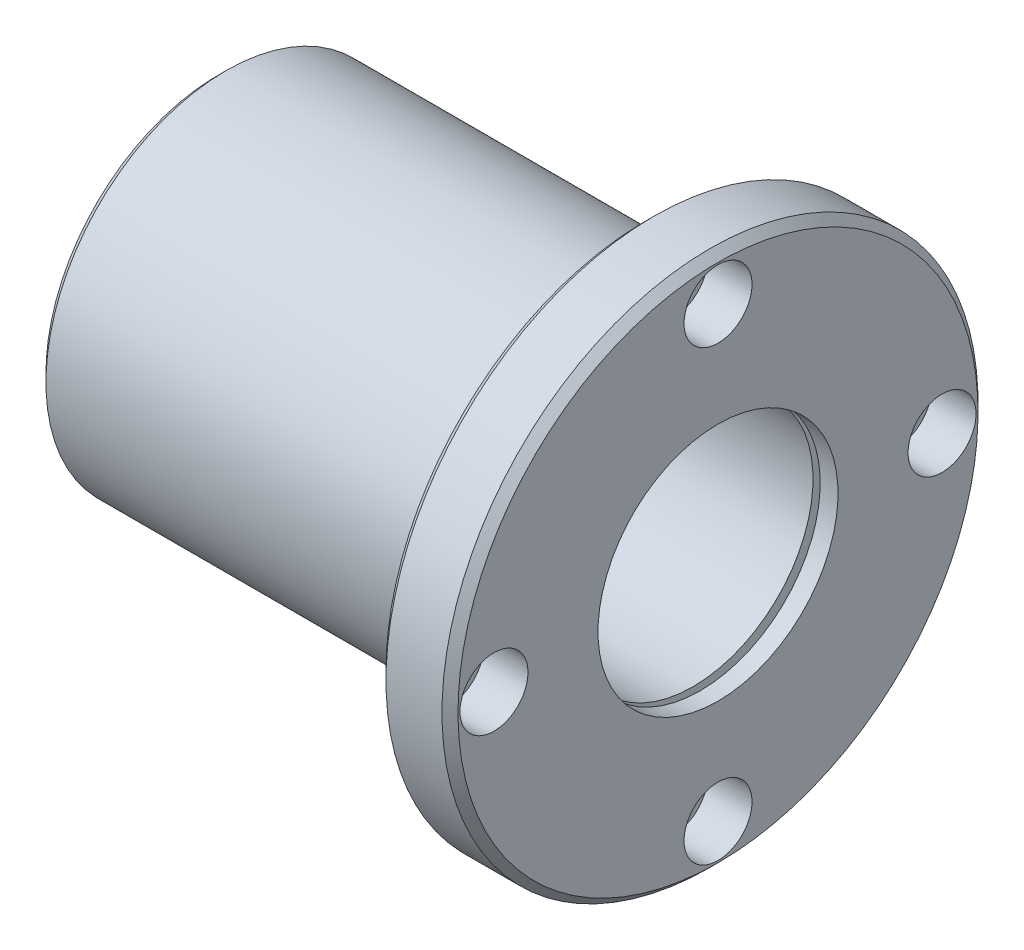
ISO-10303-21;
HEADER;
FILE_DESCRIPTION(('STEP AP214'),'2;1');
FILE_NAME('part.step','',(''),(''),'','','');
FILE_SCHEMA(('AUTOMOTIVE_DESIGN { 1 0 10303 214 1 1 1 1 }'));
ENDSEC;
DATA;
#1=APPLICATION_CONTEXT('core data for automotive mechanical design processes');
#2=APPLICATION_PROTOCOL_DEFINITION('international standard','automotive_design',2000,#1);
#3=PRODUCT_CONTEXT('',#1,'mechanical');
#4=PRODUCT('Part','Part','',(#3));
#5=PRODUCT_RELATED_PRODUCT_CATEGORY('part','',(#4));
#6=PRODUCT_DEFINITION_FORMATION('','',#4);
#7=PRODUCT_DEFINITION_CONTEXT('part definition',#1,'design');
#8=PRODUCT_DEFINITION('design','',#6,#7);
#9=PRODUCT_DEFINITION_SHAPE('','',#8);
#10=(LENGTH_UNIT() NAMED_UNIT(*) SI_UNIT(.MILLI.,.METRE.));
#11=(NAMED_UNIT(*) PLANE_ANGLE_UNIT() SI_UNIT($,.RADIAN.));
#12=(NAMED_UNIT(*) SI_UNIT($,.STERADIAN.) SOLID_ANGLE_UNIT());
#13=UNCERTAINTY_MEASURE_WITH_UNIT(LENGTH_MEASURE(1.E-05),#10,'distance_accuracy_value','');
#14=(GEOMETRIC_REPRESENTATION_CONTEXT(3) GLOBAL_UNCERTAINTY_ASSIGNED_CONTEXT((#13)) GLOBAL_UNIT_ASSIGNED_CONTEXT((#10,
#11,#12)) REPRESENTATION_CONTEXT('',''));
#15=CARTESIAN_POINT('',(0.,0.,0.));
#16=DIRECTION('',(0.,0.,1.));
#17=DIRECTION('',(1.,0.,0.));
#18=AXIS2_PLACEMENT_3D('',#15,#16,#17);
#19=CARTESIAN_POINT('',(0.,37.25,0.));
#20=DIRECTION('',(-1.,0.,0.));
#21=DIRECTION('',(0.,0.,1.));
#22=AXIS2_PLACEMENT_3D('',#19,#20,#21);
#23=PLANE('',#22);
#24=CARTESIAN_POINT('',(0.,0.,0.));
#25=DIRECTION('',(-1.,0.,0.));
#26=DIRECTION('',(0.,1.,0.));
#27=AXIS2_PLACEMENT_3D('',#24,#25,#26);
#28=CIRCLE('',#27,31.5);
#29=CARTESIAN_POINT('',(0.,-31.5,0.));
#30=VERTEX_POINT('',#29);
#31=EDGE_CURVE('E241',#30,#30,#28,.T.);
#32=ORIENTED_EDGE('',*,*,#31,.F.);
#33=EDGE_LOOP('',(#32));
#34=FACE_BOUND('',#33,.T.);
#35=CARTESIAN_POINT('',(0.,0.,0.));
#36=DIRECTION('',(-1.,0.,0.));
#37=DIRECTION('',(0.,1.,0.));
#38=AXIS2_PLACEMENT_3D('',#35,#36,#37);
#39=CIRCLE('',#38,43.);
#40=CARTESIAN_POINT('',(0.,-43.,0.));
#41=VERTEX_POINT('',#40);
#42=EDGE_CURVE('E243',#41,#41,#39,.T.);
#43=ORIENTED_EDGE('',*,*,#42,.T.);
#44=EDGE_LOOP('',(#43));
#45=FACE_BOUND('',#44,.T.);
#46=ADVANCED_FACE('F16',(#34,#45),#23,.T.);
#47=CARTESIAN_POINT('',(107.,54.7523771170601,0.));
#48=DIRECTION('',(-1.,0.,0.));
#49=DIRECTION('',(0.,0.,1.));
#50=AXIS2_PLACEMENT_3D('',#47,#48,#49);
#51=PLANE('',#50);
#52=CARTESIAN_POINT('',(107.,0.,0.));
#53=DIRECTION('',(-1.,0.,0.));
#54=DIRECTION('',(0.,1.,0.));
#55=AXIS2_PLACEMENT_3D('',#52,#53,#54);
#56=CIRCLE('',#55,44.5047542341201);
#57=CARTESIAN_POINT('',(107.,44.5047542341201,0.));
#58=VERTEX_POINT('',#57);
#59=CARTESIAN_POINT('',(107.,0.,-44.5047542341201));
#60=VERTEX_POINT('',#59);
#61=EDGE_CURVE('E530',#58,#60,#56,.T.);
#62=ORIENTED_EDGE('',*,*,#61,.F.);
#63=CARTESIAN_POINT('',(107.,0.,0.));
#64=DIRECTION('',(-1.,0.,0.));
#65=DIRECTION('',(0.,1.,0.));
#66=AXIS2_PLACEMENT_3D('',#63,#64,#65);
#67=CIRCLE('',#66,44.5047542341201);
#68=EDGE_CURVE('E534',#60,#58,#67,.T.);
#69=ORIENTED_EDGE('',*,*,#68,.F.);
#70=EDGE_LOOP('',(#62,#69));
#71=FACE_BOUND('',#70,.T.);
#72=CARTESIAN_POINT('',(107.,56.,0.));
#73=DIRECTION('',(1.,0.,0.));
#74=DIRECTION('',(0.,1.,0.));
#75=AXIS2_PLACEMENT_3D('',#72,#73,#74);
#76=CIRCLE('',#75,5.5);
#77=CARTESIAN_POINT('',(107.,50.5,0.));
#78=VERTEX_POINT('',#77);
#79=EDGE_CURVE('E355',#78,#78,#76,.T.);
#80=ORIENTED_EDGE('',*,*,#79,.T.);
#81=EDGE_LOOP('',(#80));
#82=FACE_BOUND('',#81,.T.);
#83=CARTESIAN_POINT('',(107.,-56.,0.));
#84=DIRECTION('',(1.,0.,0.));
#85=DIRECTION('',(0.,1.,0.));
#86=AXIS2_PLACEMENT_3D('',#83,#84,#85);
#87=CIRCLE('',#86,5.5);
#88=CARTESIAN_POINT('',(107.,-61.5,0.));
#89=VERTEX_POINT('',#88);
#90=EDGE_CURVE('E322',#89,#89,#87,.T.);
#91=ORIENTED_EDGE('',*,*,#90,.T.);
#92=EDGE_LOOP('',(#91));
#93=FACE_BOUND('',#92,.T.);
#94=CARTESIAN_POINT('',(107.,0.,56.));
#95=DIRECTION('',(1.,0.,0.));
#96=DIRECTION('',(0.,0.,-1.));
#97=AXIS2_PLACEMENT_3D('',#94,#95,#96);
#98=CIRCLE('',#97,5.5);
#99=CARTESIAN_POINT('',(107.,0.,61.5));
#100=VERTEX_POINT('',#99);
#101=EDGE_CURVE('E385',#100,#100,#98,.T.);
#102=ORIENTED_EDGE('',*,*,#101,.T.);
#103=EDGE_LOOP('',(#102));
#104=FACE_BOUND('',#103,.T.);
#105=CARTESIAN_POINT('',(107.,0.,-56.));
#106=DIRECTION('',(1.,0.,0.));
#107=DIRECTION('',(0.,0.,-1.));
#108=AXIS2_PLACEMENT_3D('',#105,#106,#107);
#109=CIRCLE('',#108,5.5);
#110=CARTESIAN_POINT('',(107.,0.,-50.5));
#111=VERTEX_POINT('',#110);
#112=EDGE_CURVE('E188',#111,#111,#109,.T.);
#113=ORIENTED_EDGE('',*,*,#112,.T.);
#114=EDGE_LOOP('',(#113));
#115=FACE_BOUND('',#114,.T.);
#116=CARTESIAN_POINT('',(107.,0.,0.));
#117=DIRECTION('',(-1.,0.,0.));
#118=DIRECTION('',(0.,1.,0.));
#119=AXIS2_PLACEMENT_3D('',#116,#117,#118);
#120=CIRCLE('',#119,65.);
#121=CARTESIAN_POINT('',(107.,-65.,0.));
#122=VERTEX_POINT('',#121);
#123=EDGE_CURVE('E272',#122,#122,#120,.T.);
#124=ORIENTED_EDGE('',*,*,#123,.T.);
#125=EDGE_LOOP('',(#124));
#126=FACE_BOUND('',#125,.T.);
#127=ADVANCED_FACE('F193',(#71,#82,#93,#104,#115,#126),#51,.T.);
#128=CARTESIAN_POINT('',(125.,47.5,0.));
#129=DIRECTION('',(1.,0.,0.));
#130=DIRECTION('',(0.,1.,0.));
#131=AXIS2_PLACEMENT_3D('',#128,#129,#130);
#132=PLANE('',#131);
#133=CARTESIAN_POINT('',(125.,56.,0.));
#134=DIRECTION('',(-1.,0.,0.));
#135=DIRECTION('',(0.,1.,0.));
#136=AXIS2_PLACEMENT_3D('',#133,#134,#135);
#137=CIRCLE('',#136,8.5);
#138=CARTESIAN_POINT('',(125.,47.5,0.));
#139=VERTEX_POINT('',#138);
#140=EDGE_CURVE('E365',#139,#139,#137,.T.);
#141=ORIENTED_EDGE('',*,*,#140,.T.);
#142=EDGE_LOOP('',(#141));
#143=FACE_BOUND('',#142,.T.);
#144=CARTESIAN_POINT('',(125.,-56.,0.));
#145=DIRECTION('',(-1.,0.,0.));
#146=DIRECTION('',(0.,1.,0.));
#147=AXIS2_PLACEMENT_3D('',#144,#145,#146);
#148=CIRCLE('',#147,8.5);
#149=CARTESIAN_POINT('',(125.,-64.5,0.));
#150=VERTEX_POINT('',#149);
#151=EDGE_CURVE('E382',#150,#150,#148,.T.);
#152=ORIENTED_EDGE('',*,*,#151,.T.);
#153=EDGE_LOOP('',(#152));
#154=FACE_BOUND('',#153,.T.);
#155=CARTESIAN_POINT('',(125.,0.,56.));
#156=DIRECTION('',(-1.,0.,0.));
#157=DIRECTION('',(0.,0.,-1.));
#158=AXIS2_PLACEMENT_3D('',#155,#156,#157);
#159=CIRCLE('',#158,8.5);
#160=CARTESIAN_POINT('',(125.,0.,64.5));
#161=VERTEX_POINT('',#160);
#162=EDGE_CURVE('E196',#161,#161,#159,.T.);
#163=ORIENTED_EDGE('',*,*,#162,.T.);
#164=EDGE_LOOP('',(#163));
#165=FACE_BOUND('',#164,.T.);
#166=CARTESIAN_POINT('',(125.,0.,-56.));
#167=DIRECTION('',(-1.,0.,0.));
#168=DIRECTION('',(0.,0.,-1.));
#169=AXIS2_PLACEMENT_3D('',#166,#167,#168);
#170=CIRCLE('',#169,8.5);
#171=CARTESIAN_POINT('',(125.,0.,-47.5));
#172=VERTEX_POINT('',#171);
#173=EDGE_CURVE('E10',#172,#172,#170,.T.);
#174=ORIENTED_EDGE('',*,*,#173,.T.);
#175=EDGE_LOOP('',(#174));
#176=FACE_BOUND('',#175,.T.);
#177=CARTESIAN_POINT('',(125.,0.,0.));
#178=DIRECTION('',(-1.,0.,0.));
#179=DIRECTION('',(0.,1.,0.));
#180=AXIS2_PLACEMENT_3D('',#177,#178,#179);
#181=CIRCLE('',#180,30.);
#182=CARTESIAN_POINT('',(125.,-30.,0.));
#183=VERTEX_POINT('',#182);
#184=EDGE_CURVE('E294',#183,#183,#181,.T.);
#185=ORIENTED_EDGE('',*,*,#184,.T.);
#186=EDGE_LOOP('',(#185));
#187=FACE_BOUND('',#186,.T.);
#188=CARTESIAN_POINT('',(125.,0.,0.));
#189=DIRECTION('',(-1.,0.,0.));
#190=DIRECTION('',(0.,1.,0.));
#191=AXIS2_PLACEMENT_3D('',#188,#189,#190);
#192=CIRCLE('',#191,65.);
#193=CARTESIAN_POINT('',(125.,-65.,0.));
#194=VERTEX_POINT('',#193);
#195=EDGE_CURVE('E283',#194,#194,#192,.T.);
#196=ORIENTED_EDGE('',*,*,#195,.F.);
#197=EDGE_LOOP('',(#196));
#198=FACE_BOUND('',#197,.T.);
#199=ADVANCED_FACE('F236',(#143,#154,#165,#176,#187,#198),#132,.T.);
#200=CARTESIAN_POINT('',(120.535714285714,32.25,0.));
#201=DIRECTION('',(-1.,0.,0.));
#202=DIRECTION('',(0.,1.,0.));
#203=AXIS2_PLACEMENT_3D('',#200,#201,#202);
#204=PLANE('',#203);
#205=CARTESIAN_POINT('',(120.535714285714,0.,0.));
#206=DIRECTION('',(-1.,0.,0.));
#207=DIRECTION('',(0.,1.,0.));
#208=AXIS2_PLACEMENT_3D('',#205,#206,#207);
#209=CIRCLE('',#208,30.);
#210=CARTESIAN_POINT('',(120.535714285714,-30.,0.));
#211=VERTEX_POINT('',#210);
#212=EDGE_CURVE('E286',#211,#211,#209,.T.);
#213=ORIENTED_EDGE('',*,*,#212,.F.);
#214=EDGE_LOOP('',(#213));
#215=FACE_BOUND('',#214,.T.);
#216=CARTESIAN_POINT('',(120.535714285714,0.,0.));
#217=DIRECTION('',(-1.,0.,0.));
#218=DIRECTION('',(0.,1.,0.));
#219=AXIS2_PLACEMENT_3D('',#216,#217,#218);
#220=CIRCLE('',#219,34.5);
#221=CARTESIAN_POINT('',(120.535714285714,-34.5,0.));
#222=VERTEX_POINT('',#221);
#223=EDGE_CURVE('E309',#222,#222,#220,.T.);
#224=ORIENTED_EDGE('',*,*,#223,.T.);
#225=EDGE_LOOP('',(#224));
#226=FACE_BOUND('',#225,.T.);
#227=ADVANCED_FACE('F460',(#215,#226),#204,.T.);
#228=CARTESIAN_POINT('',(118.75,32.25,0.));
#229=DIRECTION('',(1.,0.,0.));
#230=DIRECTION('',(0.,-1.,0.));
#231=AXIS2_PLACEMENT_3D('',#228,#229,#230);
#232=PLANE('',#231);
#233=CARTESIAN_POINT('',(118.75,0.,0.));
#234=DIRECTION('',(-1.,0.,0.));
#235=DIRECTION('',(0.,1.,0.));
#236=AXIS2_PLACEMENT_3D('',#233,#234,#235);
#237=CIRCLE('',#236,30.);
#238=CARTESIAN_POINT('',(118.75,-30.,0.));
#239=VERTEX_POINT('',#238);
#240=EDGE_CURVE('E326',#239,#239,#237,.T.);
#241=ORIENTED_EDGE('',*,*,#240,.T.);
#242=EDGE_LOOP('',(#241));
#243=FACE_BOUND('',#242,.T.);
#244=CARTESIAN_POINT('',(118.75,0.,0.));
#245=DIRECTION('',(-1.,0.,0.));
#246=DIRECTION('',(0.,1.,0.));
#247=AXIS2_PLACEMENT_3D('',#244,#245,#246);
#248=CIRCLE('',#247,34.5);
#249=CARTESIAN_POINT('',(118.75,-34.5,0.));
#250=VERTEX_POINT('',#249);
#251=EDGE_CURVE('E301',#250,#250,#248,.T.);
#252=ORIENTED_EDGE('',*,*,#251,.F.);
#253=EDGE_LOOP('',(#252));
#254=FACE_BOUND('',#253,.T.);
#255=ADVANCED_FACE('F456',(#243,#254),#232,.T.);
#256=CARTESIAN_POINT('',(6.25,32.25,0.));
#257=DIRECTION('',(-1.,0.,0.));
#258=DIRECTION('',(0.,0.,1.));
#259=AXIS2_PLACEMENT_3D('',#256,#257,#258);
#260=PLANE('',#259);
#261=CARTESIAN_POINT('',(6.25,0.,0.));
#262=DIRECTION('',(-1.,0.,0.));
#263=DIRECTION('',(0.,1.,0.));
#264=AXIS2_PLACEMENT_3D('',#261,#262,#263);
#265=CIRCLE('',#264,30.);
#266=CARTESIAN_POINT('',(6.25,-30.,0.));
#267=VERTEX_POINT('',#266);
#268=EDGE_CURVE('E312',#267,#267,#265,.T.);
#269=ORIENTED_EDGE('',*,*,#268,.F.);
#270=EDGE_LOOP('',(#269));
#271=FACE_BOUND('',#270,.T.);
#272=CARTESIAN_POINT('',(6.25,0.,0.));
#273=DIRECTION('',(-1.,0.,0.));
#274=DIRECTION('',(0.,1.,0.));
#275=AXIS2_PLACEMENT_3D('',#272,#273,#274);
#276=CIRCLE('',#275,34.5);
#277=CARTESIAN_POINT('',(6.25,-34.5,0.));
#278=VERTEX_POINT('',#277);
#279=EDGE_CURVE('E337',#278,#278,#276,.T.);
#280=ORIENTED_EDGE('',*,*,#279,.T.);
#281=EDGE_LOOP('',(#280));
#282=FACE_BOUND('',#281,.T.);
#283=ADVANCED_FACE('F452',(#271,#282),#260,.T.);
#284=CARTESIAN_POINT('',(4.46428571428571,33.,0.));
#285=DIRECTION('',(1.,0.,0.));
#286=DIRECTION('',(0.,1.,0.));
#287=AXIS2_PLACEMENT_3D('',#284,#285,#286);
#288=PLANE('',#287);
#289=CARTESIAN_POINT('',(4.46428571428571,0.,0.));
#290=DIRECTION('',(-1.,0.,0.));
#291=DIRECTION('',(0.,1.,0.));
#292=AXIS2_PLACEMENT_3D('',#289,#290,#291);
#293=CIRCLE('',#292,31.5);
#294=CARTESIAN_POINT('',(4.46428571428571,-31.5,0.));
#295=VERTEX_POINT('',#294);
#296=EDGE_CURVE('E352',#295,#295,#293,.T.);
#297=ORIENTED_EDGE('',*,*,#296,.T.);
#298=EDGE_LOOP('',(#297));
#299=FACE_BOUND('',#298,.T.);
#300=CARTESIAN_POINT('',(4.46428571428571,0.,0.));
#301=DIRECTION('',(-1.,0.,0.));
#302=DIRECTION('',(0.,1.,0.));
#303=AXIS2_PLACEMENT_3D('',#300,#301,#302);
#304=CIRCLE('',#303,34.5);
#305=CARTESIAN_POINT('',(4.46428571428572,-34.5,0.));
#306=VERTEX_POINT('',#305);
#307=EDGE_CURVE('E329',#306,#306,#304,.T.);
#308=ORIENTED_EDGE('',*,*,#307,.F.);
#309=EDGE_LOOP('',(#308));
#310=FACE_BOUND('',#309,.T.);
#311=ADVANCED_FACE('F448',(#299,#310),#288,.T.);
#312=CARTESIAN_POINT('',(113.9,63.,0.));
#313=DIRECTION('',(-1.,0.,0.));
#314=DIRECTION('',(0.,0.,1.));
#315=AXIS2_PLACEMENT_3D('',#312,#313,#314);
#316=PLANE('',#315);
#317=CARTESIAN_POINT('',(113.9,56.,0.));
#318=DIRECTION('',(-1.,0.,0.));
#319=DIRECTION('',(0.,1.,0.));
#320=AXIS2_PLACEMENT_3D('',#317,#318,#319);
#321=CIRCLE('',#320,5.5);
#322=CARTESIAN_POINT('',(113.9,50.5,0.));
#323=VERTEX_POINT('',#322);
#324=EDGE_CURVE('E343',#323,#323,#321,.T.);
#325=ORIENTED_EDGE('',*,*,#324,.T.);
#326=EDGE_LOOP('',(#325));
#327=FACE_BOUND('',#326,.T.);
#328=CARTESIAN_POINT('',(113.9,56.,0.));
#329=DIRECTION('',(-1.,0.,0.));
#330=DIRECTION('',(0.,1.,0.));
#331=AXIS2_PLACEMENT_3D('',#328,#329,#330);
#332=CIRCLE('',#331,8.5);
#333=CARTESIAN_POINT('',(113.9,47.5,0.));
#334=VERTEX_POINT('',#333);
#335=EDGE_CURVE('E338',#334,#334,#332,.T.);
#336=ORIENTED_EDGE('',*,*,#335,.F.);
#337=EDGE_LOOP('',(#336));
#338=FACE_BOUND('',#337,.T.);
#339=ADVANCED_FACE('F410',(#327,#338),#316,.F.);
#340=CARTESIAN_POINT('',(113.9,-49.,0.));
#341=DIRECTION('',(-1.,0.,0.));
#342=DIRECTION('',(0.,0.,1.));
#343=AXIS2_PLACEMENT_3D('',#340,#341,#342);
#344=PLANE('',#343);
#345=CARTESIAN_POINT('',(113.9,-56.,0.));
#346=DIRECTION('',(-1.,0.,0.));
#347=DIRECTION('',(0.,1.,0.));
#348=AXIS2_PLACEMENT_3D('',#345,#346,#347);
#349=CIRCLE('',#348,5.5);
#350=CARTESIAN_POINT('',(113.9,-61.5,0.));
#351=VERTEX_POINT('',#350);
#352=EDGE_CURVE('E321',#351,#351,#349,.T.);
#353=ORIENTED_EDGE('',*,*,#352,.T.);
#354=EDGE_LOOP('',(#353));
#355=FACE_BOUND('',#354,.T.);
#356=CARTESIAN_POINT('',(113.9,-56.,0.));
#357=DIRECTION('',(-1.,0.,0.));
#358=DIRECTION('',(0.,1.,0.));
#359=AXIS2_PLACEMENT_3D('',#356,#357,#358);
#360=CIRCLE('',#359,8.5);
#361=CARTESIAN_POINT('',(113.9,-64.5,0.));
#362=VERTEX_POINT('',#361);
#363=EDGE_CURVE('E374',#362,#362,#360,.T.);
#364=ORIENTED_EDGE('',*,*,#363,.F.);
#365=EDGE_LOOP('',(#364));
#366=FACE_BOUND('',#365,.T.);
#367=ADVANCED_FACE('F404',(#355,#366),#344,.F.);
#368=CARTESIAN_POINT('',(113.9,0.,49.));
#369=DIRECTION('',(-1.,0.,0.));
#370=DIRECTION('',(0.,0.,1.));
#371=AXIS2_PLACEMENT_3D('',#368,#369,#370);
#372=PLANE('',#371);
#373=CARTESIAN_POINT('',(113.9,0.,56.));
#374=DIRECTION('',(-1.,0.,0.));
#375=DIRECTION('',(0.,0.,-1.));
#376=AXIS2_PLACEMENT_3D('',#373,#374,#375);
#377=CIRCLE('',#376,5.5);
#378=CARTESIAN_POINT('',(113.9,0.,61.5));
#379=VERTEX_POINT('',#378);
#380=EDGE_CURVE('E393',#379,#379,#377,.T.);
#381=ORIENTED_EDGE('',*,*,#380,.T.);
#382=EDGE_LOOP('',(#381));
#383=FACE_BOUND('',#382,.T.);
#384=CARTESIAN_POINT('',(113.9,0.,56.));
#385=DIRECTION('',(-1.,0.,0.));
#386=DIRECTION('',(0.,0.,-1.));
#387=AXIS2_PLACEMENT_3D('',#384,#385,#386);
#388=CIRCLE('',#387,8.5);
#389=CARTESIAN_POINT('',(113.9,0.,64.5));
#390=VERTEX_POINT('',#389);
#391=EDGE_CURVE('E298',#390,#390,#388,.T.);
#392=ORIENTED_EDGE('',*,*,#391,.F.);
#393=EDGE_LOOP('',(#392));
#394=FACE_BOUND('',#393,.T.);
#395=ADVANCED_FACE('F226',(#383,#394),#372,.F.);
#396=CARTESIAN_POINT('',(113.9,0.,-63.));
#397=DIRECTION('',(-1.,0.,0.));
#398=DIRECTION('',(0.,0.,1.));
#399=AXIS2_PLACEMENT_3D('',#396,#397,#398);
#400=PLANE('',#399);
#401=CARTESIAN_POINT('',(113.9,0.,-56.));
#402=DIRECTION('',(-1.,0.,0.));
#403=DIRECTION('',(0.,0.,-1.));
#404=AXIS2_PLACEMENT_3D('',#401,#402,#403);
#405=CIRCLE('',#404,5.5);
#406=CARTESIAN_POINT('',(113.9,0.,-50.5));
#407=VERTEX_POINT('',#406);
#408=EDGE_CURVE('E189',#407,#407,#405,.T.);
#409=ORIENTED_EDGE('',*,*,#408,.T.);
#410=EDGE_LOOP('',(#409));
#411=FACE_BOUND('',#410,.T.);
#412=CARTESIAN_POINT('',(113.9,0.,-56.));
#413=DIRECTION('',(-1.,0.,0.));
#414=DIRECTION('',(0.,0.,-1.));
#415=AXIS2_PLACEMENT_3D('',#412,#413,#414);
#416=CIRCLE('',#415,8.5);
#417=CARTESIAN_POINT('',(113.9,0.,-47.5));
#418=VERTEX_POINT('',#417);
#419=EDGE_CURVE('E207',#418,#418,#416,.T.);
#420=ORIENTED_EDGE('',*,*,#419,.F.);
#421=EDGE_LOOP('',(#420));
#422=FACE_BOUND('',#421,.T.);
#423=ADVANCED_FACE('F217',(#411,#422),#400,.F.);
#424=CARTESIAN_POINT('',(119.45,0.,-56.));
#425=DIRECTION('',(1.,0.,0.));
#426=DIRECTION('',(0.,0.,-1.));
#427=AXIS2_PLACEMENT_3D('',#424,#425,#426);
#428=CYLINDRICAL_SURFACE('',#427,8.5);
#429=ORIENTED_EDGE('',*,*,#419,.T.);
#430=DIRECTION('',(1.,0.,0.));
#431=VECTOR('',#430,1.);
#432=CARTESIAN_POINT('',(119.45,0.,-47.5));
#433=LINE('',#432,#431);
#434=EDGE_CURVE('E19',#418,#172,#433,.T.);
#435=ORIENTED_EDGE('',*,*,#434,.T.);
#436=ORIENTED_EDGE('',*,*,#173,.F.);
#437=ORIENTED_EDGE('',*,*,#434,.F.);
#438=EDGE_LOOP('',(#429,#435,#436,#437));
#439=FACE_BOUND('',#438,.T.);
#440=ADVANCED_FACE('F215',(#439),#428,.F.);
#441=CARTESIAN_POINT('',(110.45,0.,-56.));
#442=DIRECTION('',(1.,0.,0.));
#443=DIRECTION('',(0.,0.,-1.));
#444=AXIS2_PLACEMENT_3D('',#441,#442,#443);
#445=CYLINDRICAL_SURFACE('',#444,5.5);
#446=ORIENTED_EDGE('',*,*,#112,.F.);
#447=DIRECTION('',(1.,0.,0.));
#448=VECTOR('',#447,1.);
#449=CARTESIAN_POINT('',(110.45,0.,-50.5));
#450=LINE('',#449,#448);
#451=EDGE_CURVE('E185',#111,#407,#450,.T.);
#452=ORIENTED_EDGE('',*,*,#451,.T.);
#453=ORIENTED_EDGE('',*,*,#408,.F.);
#454=ORIENTED_EDGE('',*,*,#451,.F.);
#455=EDGE_LOOP('',(#446,#452,#453,#454));
#456=FACE_BOUND('',#455,.T.);
#457=ADVANCED_FACE('F187',(#456),#445,.F.);
#458=CARTESIAN_POINT('',(119.45,0.,56.));
#459=DIRECTION('',(1.,0.,0.));
#460=DIRECTION('',(0.,0.,-1.));
#461=AXIS2_PLACEMENT_3D('',#458,#459,#460);
#462=CYLINDRICAL_SURFACE('',#461,8.5);
#463=ORIENTED_EDGE('',*,*,#391,.T.);
#464=DIRECTION('',(1.,0.,0.));
#465=VECTOR('',#464,1.);
#466=CARTESIAN_POINT('',(119.45,0.,64.5));
#467=LINE('',#466,#465);
#468=EDGE_CURVE('E202',#390,#161,#467,.T.);
#469=ORIENTED_EDGE('',*,*,#468,.T.);
#470=ORIENTED_EDGE('',*,*,#162,.F.);
#471=ORIENTED_EDGE('',*,*,#468,.F.);
#472=EDGE_LOOP('',(#463,#469,#470,#471));
#473=FACE_BOUND('',#472,.T.);
#474=ADVANCED_FACE('F224',(#473),#462,.F.);
#475=CARTESIAN_POINT('',(110.45,0.,56.));
#476=DIRECTION('',(1.,0.,0.));
#477=DIRECTION('',(0.,0.,-1.));
#478=AXIS2_PLACEMENT_3D('',#475,#476,#477);
#479=CYLINDRICAL_SURFACE('',#478,5.5);
#480=ORIENTED_EDGE('',*,*,#101,.F.);
#481=DIRECTION('',(1.,0.,0.));
#482=VECTOR('',#481,1.);
#483=CARTESIAN_POINT('',(110.45,0.,61.5));
#484=LINE('',#483,#482);
#485=EDGE_CURVE('E389',#100,#379,#484,.T.);
#486=ORIENTED_EDGE('',*,*,#485,.T.);
#487=ORIENTED_EDGE('',*,*,#380,.F.);
#488=ORIENTED_EDGE('',*,*,#485,.F.);
#489=EDGE_LOOP('',(#480,#486,#487,#488));
#490=FACE_BOUND('',#489,.T.);
#491=ADVANCED_FACE('F428',(#490),#479,.F.);
#492=CARTESIAN_POINT('',(119.45,-56.,0.));
#493=DIRECTION('',(1.,0.,0.));
#494=DIRECTION('',(0.,1.,0.));
#495=AXIS2_PLACEMENT_3D('',#492,#493,#494);
#496=CYLINDRICAL_SURFACE('',#495,8.5);
#497=ORIENTED_EDGE('',*,*,#363,.T.);
#498=DIRECTION('',(1.,0.,0.));
#499=VECTOR('',#498,1.);
#500=CARTESIAN_POINT('',(119.45,-64.5,0.));
#501=LINE('',#500,#499);
#502=EDGE_CURVE('E378',#362,#150,#501,.T.);
#503=ORIENTED_EDGE('',*,*,#502,.T.);
#504=ORIENTED_EDGE('',*,*,#151,.F.);
#505=ORIENTED_EDGE('',*,*,#502,.F.);
#506=EDGE_LOOP('',(#497,#503,#504,#505));
#507=FACE_BOUND('',#506,.T.);
#508=ADVANCED_FACE('F419',(#507),#496,.F.);
#509=CARTESIAN_POINT('',(110.45,-56.,0.));
#510=DIRECTION('',(1.,0.,0.));
#511=DIRECTION('',(0.,1.,0.));
#512=AXIS2_PLACEMENT_3D('',#509,#510,#511);
#513=CYLINDRICAL_SURFACE('',#512,5.5);
#514=ORIENTED_EDGE('',*,*,#90,.F.);
#515=DIRECTION('',(1.,0.,0.));
#516=VECTOR('',#515,1.);
#517=CARTESIAN_POINT('',(110.45,-61.5,0.));
#518=LINE('',#517,#516);
#519=EDGE_CURVE('E317',#89,#351,#518,.T.);
#520=ORIENTED_EDGE('',*,*,#519,.T.);
#521=ORIENTED_EDGE('',*,*,#352,.F.);
#522=ORIENTED_EDGE('',*,*,#519,.F.);
#523=EDGE_LOOP('',(#514,#520,#521,#522));
#524=FACE_BOUND('',#523,.T.);
#525=ADVANCED_FACE('F416',(#524),#513,.F.);
#526=CARTESIAN_POINT('',(119.45,56.,0.));
#527=DIRECTION('',(1.,0.,0.));
#528=DIRECTION('',(0.,1.,0.));
#529=AXIS2_PLACEMENT_3D('',#526,#527,#528);
#530=CYLINDRICAL_SURFACE('',#529,8.5);
#531=ORIENTED_EDGE('',*,*,#335,.T.);
#532=DIRECTION('',(1.,0.,0.));
#533=VECTOR('',#532,1.);
#534=CARTESIAN_POINT('',(119.45,47.5,0.));
#535=LINE('',#534,#533);
#536=EDGE_CURVE('E342',#334,#139,#535,.T.);
#537=ORIENTED_EDGE('',*,*,#536,.T.);
#538=ORIENTED_EDGE('',*,*,#140,.F.);
#539=ORIENTED_EDGE('',*,*,#536,.F.);
#540=EDGE_LOOP('',(#531,#537,#538,#539));
#541=FACE_BOUND('',#540,.T.);
#542=ADVANCED_FACE('F418',(#541),#530,.F.);
#543=CARTESIAN_POINT('',(110.45,56.,0.));
#544=DIRECTION('',(1.,0.,0.));
#545=DIRECTION('',(0.,1.,0.));
#546=AXIS2_PLACEMENT_3D('',#543,#544,#545);
#547=CYLINDRICAL_SURFACE('',#546,5.5);
#548=ORIENTED_EDGE('',*,*,#79,.F.);
#549=DIRECTION('',(1.,0.,0.));
#550=VECTOR('',#549,1.);
#551=CARTESIAN_POINT('',(110.45,50.5,0.));
#552=LINE('',#551,#550);
#553=EDGE_CURVE('E359',#78,#323,#552,.T.);
#554=ORIENTED_EDGE('',*,*,#553,.T.);
#555=ORIENTED_EDGE('',*,*,#324,.F.);
#556=ORIENTED_EDGE('',*,*,#553,.F.);
#557=EDGE_LOOP('',(#548,#554,#555,#556));
#558=FACE_BOUND('',#557,.T.);
#559=ADVANCED_FACE('F425',(#558),#547,.F.);
#560=CARTESIAN_POINT('',(2.23214285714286,0.,0.));
#561=DIRECTION('',(1.,0.,0.));
#562=DIRECTION('',(0.,1.,0.));
#563=AXIS2_PLACEMENT_3D('',#560,#561,#562);
#564=CYLINDRICAL_SURFACE('',#563,31.5);
#565=ORIENTED_EDGE('',*,*,#31,.T.);
#566=DIRECTION('',(1.,0.,0.));
#567=VECTOR('',#566,1.);
#568=CARTESIAN_POINT('',(2.23214285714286,-31.5,0.));
#569=LINE('',#568,#567);
#570=EDGE_CURVE('E348',#30,#295,#569,.T.);
#571=ORIENTED_EDGE('',*,*,#570,.T.);
#572=ORIENTED_EDGE('',*,*,#296,.F.);
#573=ORIENTED_EDGE('',*,*,#570,.F.);
#574=EDGE_LOOP('',(#565,#571,#572,#573));
#575=FACE_BOUND('',#574,.T.);
#576=ADVANCED_FACE('F497',(#575),#564,.F.);
#577=CARTESIAN_POINT('',(5.35714285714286,0.,0.));
#578=DIRECTION('',(1.,0.,0.));
#579=DIRECTION('',(0.,1.,0.));
#580=AXIS2_PLACEMENT_3D('',#577,#578,#579);
#581=CYLINDRICAL_SURFACE('',#580,34.5);
#582=ORIENTED_EDGE('',*,*,#307,.T.);
#583=DIRECTION('',(1.,0.,0.));
#584=VECTOR('',#583,1.);
#585=CARTESIAN_POINT('',(5.35714285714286,-34.5,0.));
#586=LINE('',#585,#584);
#587=EDGE_CURVE('E333',#306,#278,#586,.T.);
#588=ORIENTED_EDGE('',*,*,#587,.T.);
#589=ORIENTED_EDGE('',*,*,#279,.F.);
#590=ORIENTED_EDGE('',*,*,#587,.F.);
#591=EDGE_LOOP('',(#582,#588,#589,#590));
#592=FACE_BOUND('',#591,.T.);
#593=ADVANCED_FACE('F502',(#592),#581,.F.);
#594=CARTESIAN_POINT('',(62.5,0.,0.));
#595=DIRECTION('',(1.,0.,0.));
#596=DIRECTION('',(0.,1.,0.));
#597=AXIS2_PLACEMENT_3D('',#594,#595,#596);
#598=CYLINDRICAL_SURFACE('',#597,30.);
#599=ORIENTED_EDGE('',*,*,#268,.T.);
#600=DIRECTION('',(1.,0.,0.));
#601=VECTOR('',#600,1.);
#602=CARTESIAN_POINT('',(62.5,-30.,0.));
#603=LINE('',#602,#601);
#604=EDGE_CURVE('E316',#267,#239,#603,.T.);
#605=ORIENTED_EDGE('',*,*,#604,.T.);
#606=ORIENTED_EDGE('',*,*,#240,.F.);
#607=ORIENTED_EDGE('',*,*,#604,.F.);
#608=EDGE_LOOP('',(#599,#605,#606,#607));
#609=FACE_BOUND('',#608,.T.);
#610=ADVANCED_FACE('F627',(#609),#598,.F.);
#611=CARTESIAN_POINT('',(119.642857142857,0.,0.));
#612=DIRECTION('',(1.,0.,0.));
#613=DIRECTION('',(0.,1.,0.));
#614=AXIS2_PLACEMENT_3D('',#611,#612,#613);
#615=CYLINDRICAL_SURFACE('',#614,34.5);
#616=ORIENTED_EDGE('',*,*,#251,.T.);
#617=DIRECTION('',(1.,0.,0.));
#618=VECTOR('',#617,1.);
#619=CARTESIAN_POINT('',(119.642857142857,-34.5,0.));
#620=LINE('',#619,#618);
#621=EDGE_CURVE('E305',#250,#222,#620,.T.);
#622=ORIENTED_EDGE('',*,*,#621,.T.);
#623=ORIENTED_EDGE('',*,*,#223,.F.);
#624=ORIENTED_EDGE('',*,*,#621,.F.);
#625=EDGE_LOOP('',(#616,#622,#623,#624));
#626=FACE_BOUND('',#625,.T.);
#627=ADVANCED_FACE('F616',(#626),#615,.F.);
#628=CARTESIAN_POINT('',(122.767857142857,0.,0.));
#629=DIRECTION('',(1.,0.,0.));
#630=DIRECTION('',(0.,1.,0.));
#631=AXIS2_PLACEMENT_3D('',#628,#629,#630);
#632=CYLINDRICAL_SURFACE('',#631,30.);
#633=ORIENTED_EDGE('',*,*,#212,.T.);
#634=DIRECTION('',(1.,0.,0.));
#635=VECTOR('',#634,1.);
#636=CARTESIAN_POINT('',(122.767857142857,-30.,0.));
#637=LINE('',#636,#635);
#638=EDGE_CURVE('E290',#211,#183,#637,.T.);
#639=ORIENTED_EDGE('',*,*,#638,.T.);
#640=ORIENTED_EDGE('',*,*,#184,.F.);
#641=ORIENTED_EDGE('',*,*,#638,.F.);
#642=EDGE_LOOP('',(#633,#639,#640,#641));
#643=FACE_BOUND('',#642,.T.);
#644=ADVANCED_FACE('F607',(#643),#632,.F.);
#645=CARTESIAN_POINT('',(124.,0.,0.));
#646=DIRECTION('',(-1.,0.,0.));
#647=DIRECTION('',(0.,1.,0.));
#648=AXIS2_PLACEMENT_3D('',#645,#646,#647);
#649=CONICAL_SURFACE('',#648,66.,0.785398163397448);
#650=CARTESIAN_POINT('',(123.,0.,0.));
#651=DIRECTION('',(-1.,0.,0.));
#652=DIRECTION('',(0.,1.,0.));
#653=AXIS2_PLACEMENT_3D('',#650,#651,#652);
#654=CIRCLE('',#653,67.);
#655=CARTESIAN_POINT('',(123.,-67.,0.));
#656=VERTEX_POINT('',#655);
#657=EDGE_CURVE('E275',#656,#656,#654,.T.);
#658=ORIENTED_EDGE('',*,*,#657,.F.);
#659=DIRECTION('',(0.707106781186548,0.707106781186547,0.));
#660=VECTOR('',#659,1.);
#661=CARTESIAN_POINT('',(124.,-66.,0.));
#662=LINE('',#661,#660);
#663=EDGE_CURVE('E282',#656,#194,#662,.T.);
#664=ORIENTED_EDGE('',*,*,#663,.T.);
#665=ORIENTED_EDGE('',*,*,#195,.T.);
#666=ORIENTED_EDGE('',*,*,#663,.F.);
#667=EDGE_LOOP('',(#658,#664,#665,#666));
#668=FACE_BOUND('',#667,.T.);
#669=ADVANCED_FACE('F480',(#668),#649,.T.);
#670=CARTESIAN_POINT('',(116.,0.,0.));
#671=DIRECTION('',(1.,0.,0.));
#672=DIRECTION('',(0.,1.,0.));
#673=AXIS2_PLACEMENT_3D('',#670,#671,#672);
#674=CYLINDRICAL_SURFACE('',#673,67.);
#675=ORIENTED_EDGE('',*,*,#657,.T.);
#676=DIRECTION('',(-1.,0.,0.));
#677=VECTOR('',#676,1.);
#678=CARTESIAN_POINT('',(116.,-67.,0.));
#679=LINE('',#678,#677);
#680=CARTESIAN_POINT('',(109.,-67.,0.));
#681=VERTEX_POINT('',#680);
#682=EDGE_CURVE('E279',#656,#681,#679,.T.);
#683=ORIENTED_EDGE('',*,*,#682,.T.);
#684=CARTESIAN_POINT('',(109.,0.,0.));
#685=DIRECTION('',(-1.,0.,0.));
#686=DIRECTION('',(0.,1.,0.));
#687=AXIS2_PLACEMENT_3D('',#684,#685,#686);
#688=CIRCLE('',#687,67.);
#689=EDGE_CURVE('E267',#681,#681,#688,.T.);
#690=ORIENTED_EDGE('',*,*,#689,.F.);
#691=ORIENTED_EDGE('',*,*,#682,.F.);
#692=EDGE_LOOP('',(#675,#683,#690,#691));
#693=FACE_BOUND('',#692,.T.);
#694=ADVANCED_FACE('F507',(#693),#674,.T.);
#695=CARTESIAN_POINT('',(108.,0.,0.));
#696=DIRECTION('',(1.,0.,0.));
#697=DIRECTION('',(0.,1.,0.));
#698=AXIS2_PLACEMENT_3D('',#695,#696,#697);
#699=CONICAL_SURFACE('',#698,66.,0.785398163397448);
#700=ORIENTED_EDGE('',*,*,#689,.T.);
#701=DIRECTION('',(-0.707106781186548,0.707106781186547,0.));
#702=VECTOR('',#701,1.);
#703=CARTESIAN_POINT('',(108.,-66.,0.));
#704=LINE('',#703,#702);
#705=EDGE_CURVE('E271',#681,#122,#704,.T.);
#706=ORIENTED_EDGE('',*,*,#705,.T.);
#707=ORIENTED_EDGE('',*,*,#123,.F.);
#708=ORIENTED_EDGE('',*,*,#705,.F.);
#709=EDGE_LOOP('',(#700,#706,#707,#708));
#710=FACE_BOUND('',#709,.T.);
#711=ADVANCED_FACE('F414',(#710),#699,.T.);
#712=CARTESIAN_POINT('',(103.932344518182,0.,0.));
#713=DIRECTION('',(-1.,0.,0.));
#714=DIRECTION('',(0.,1.,0.));
#715=AXIS2_PLACEMENT_3D('',#712,#713,#714);
#716=CONICAL_SURFACE('',#715,44.460105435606,0.227474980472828);
#717=CARTESIAN_POINT('',(101.6,0.,0.));
#718=DIRECTION('',(-1.,0.,0.));
#719=DIRECTION('',(0.,1.,0.));
#720=AXIS2_PLACEMENT_3D('',#717,#718,#719);
#721=CIRCLE('',#720,45.);
#722=CARTESIAN_POINT('',(101.6,-45.,0.));
#723=VERTEX_POINT('',#722);
#724=EDGE_CURVE('E248',#723,#723,#721,.T.);
#725=ORIENTED_EDGE('',*,*,#724,.F.);
#726=DIRECTION('',(0.974238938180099,0.225518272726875,0.));
#727=VECTOR('',#726,1.);
#728=CARTESIAN_POINT('',(103.932344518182,-44.460105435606,0.));
#729=LINE('',#728,#727);
#730=CARTESIAN_POINT('',(106.264689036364,-43.9202108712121,0.));
#731=VERTEX_POINT('',#730);
#732=EDGE_CURVE('E264',#723,#731,#729,.T.);
#733=ORIENTED_EDGE('',*,*,#732,.T.);
#734=CARTESIAN_POINT('',(106.264689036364,0.,0.));
#735=DIRECTION('',(-1.,0.,0.));
#736=DIRECTION('',(0.,1.,0.));
#737=AXIS2_PLACEMENT_3D('',#734,#735,#736);
#738=CIRCLE('',#737,43.9202108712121);
#739=CARTESIAN_POINT('',(106.264689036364,0.,-43.9202108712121));
#740=VERTEX_POINT('',#739);
#741=EDGE_CURVE('E550',#731,#740,#738,.T.);
#742=ORIENTED_EDGE('',*,*,#741,.T.);
#743=CARTESIAN_POINT('',(106.264689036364,0.,0.));
#744=DIRECTION('',(-1.,0.,0.));
#745=DIRECTION('',(0.,1.,0.));
#746=AXIS2_PLACEMENT_3D('',#743,#744,#745);
#747=CIRCLE('',#746,43.9202108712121);
#748=EDGE_CURVE('E547',#740,#731,#747,.T.);
#749=ORIENTED_EDGE('',*,*,#748,.T.);
#750=ORIENTED_EDGE('',*,*,#732,.F.);
#751=EDGE_LOOP('',(#725,#733,#742,#749,#750));
#752=FACE_BOUND('',#751,.T.);
#753=ADVANCED_FACE('F515',(#752),#716,.T.);
#754=CARTESIAN_POINT('',(51.8,0.,0.));
#755=DIRECTION('',(1.,0.,0.));
#756=DIRECTION('',(0.,1.,0.));
#757=AXIS2_PLACEMENT_3D('',#754,#755,#756);
#758=CYLINDRICAL_SURFACE('',#757,45.);
#759=ORIENTED_EDGE('',*,*,#724,.T.);
#760=DIRECTION('',(-1.,0.,0.));
#761=VECTOR('',#760,1.);
#762=CARTESIAN_POINT('',(51.8,-45.,0.));
#763=LINE('',#762,#761);
#764=CARTESIAN_POINT('',(2.,-45.,0.));
#765=VERTEX_POINT('',#764);
#766=EDGE_CURVE('E256',#723,#765,#763,.T.);
#767=ORIENTED_EDGE('',*,*,#766,.T.);
#768=CARTESIAN_POINT('',(2.,0.,0.));
#769=DIRECTION('',(-1.,0.,0.));
#770=DIRECTION('',(0.,1.,0.));
#771=AXIS2_PLACEMENT_3D('',#768,#769,#770);
#772=CIRCLE('',#771,45.);
#773=EDGE_CURVE('E258',#765,#765,#772,.T.);
#774=ORIENTED_EDGE('',*,*,#773,.F.);
#775=ORIENTED_EDGE('',*,*,#766,.F.);
#776=EDGE_LOOP('',(#759,#767,#774,#775));
#777=FACE_BOUND('',#776,.T.);
#778=ADVANCED_FACE('F512',(#777),#758,.T.);
#779=CARTESIAN_POINT('',(1.,0.,0.));
#780=DIRECTION('',(1.,0.,0.));
#781=DIRECTION('',(0.,1.,0.));
#782=AXIS2_PLACEMENT_3D('',#779,#780,#781);
#783=CONICAL_SURFACE('',#782,44.,0.785398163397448);
#784=ORIENTED_EDGE('',*,*,#773,.T.);
#785=DIRECTION('',(-0.707106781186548,0.707106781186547,0.));
#786=VECTOR('',#785,1.);
#787=CARTESIAN_POINT('',(1.,-44.,0.));
#788=LINE('',#787,#786);
#789=EDGE_CURVE('E249',#765,#41,#788,.T.);
#790=ORIENTED_EDGE('',*,*,#789,.T.);
#791=ORIENTED_EDGE('',*,*,#42,.F.);
#792=ORIENTED_EDGE('',*,*,#789,.F.);
#793=EDGE_LOOP('',(#784,#790,#791,#792));
#794=FACE_BOUND('',#793,.T.);
#795=ADVANCED_FACE('F509',(#794),#783,.T.);
#796=CARTESIAN_POINT('',(106.4,0.,0.));
#797=DIRECTION('',(-1.,0.,0.));
#798=DIRECTION('',(0.,0.,1.));
#799=AXIS2_PLACEMENT_3D('',#796,#797,#798);
#800=TOROIDAL_SURFACE('',#799,44.5047542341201,0.6);
#801=ORIENTED_EDGE('',*,*,#741,.F.);
#802=ORIENTED_EDGE('',*,*,#748,.F.);
#803=CARTESIAN_POINT('',(106.4,0.,-44.5047542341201));
#804=DIRECTION('',(0.,1.,0.));
#805=DIRECTION('',(0.,0.,-1.));
#806=AXIS2_PLACEMENT_3D('',#803,#804,#805);
#807=CIRCLE('',#806,0.6);
#808=EDGE_CURVE('E542',#740,#60,#807,.T.);
#809=ORIENTED_EDGE('',*,*,#808,.T.);
#810=ORIENTED_EDGE('',*,*,#68,.T.);
#811=ORIENTED_EDGE('',*,*,#61,.T.);
#812=ORIENTED_EDGE('',*,*,#808,.F.);
#813=EDGE_LOOP('',(#801,#802,#809,#810,#811,#812));
#814=FACE_BOUND('',#813,.T.);
#815=ADVANCED_FACE('F511',(#814),#800,.F.);
#816=CLOSED_SHELL('',(#46,#127,#199,#227,#255,#283,#311,#339,#367,#395,#423,#440,#457,#474,#491,
#508,#525,#542,#559,#576,#593,#610,#627,#644,#669,#694,#711,#753,#778,#795,#815));
#817=MANIFOLD_SOLID_BREP('B1',#816);
#818=ADVANCED_BREP_SHAPE_REPRESENTATION('',(#18,#817),#14);
#819=SHAPE_DEFINITION_REPRESENTATION(#9,#818);
ENDSEC;
END-ISO-10303-21;
